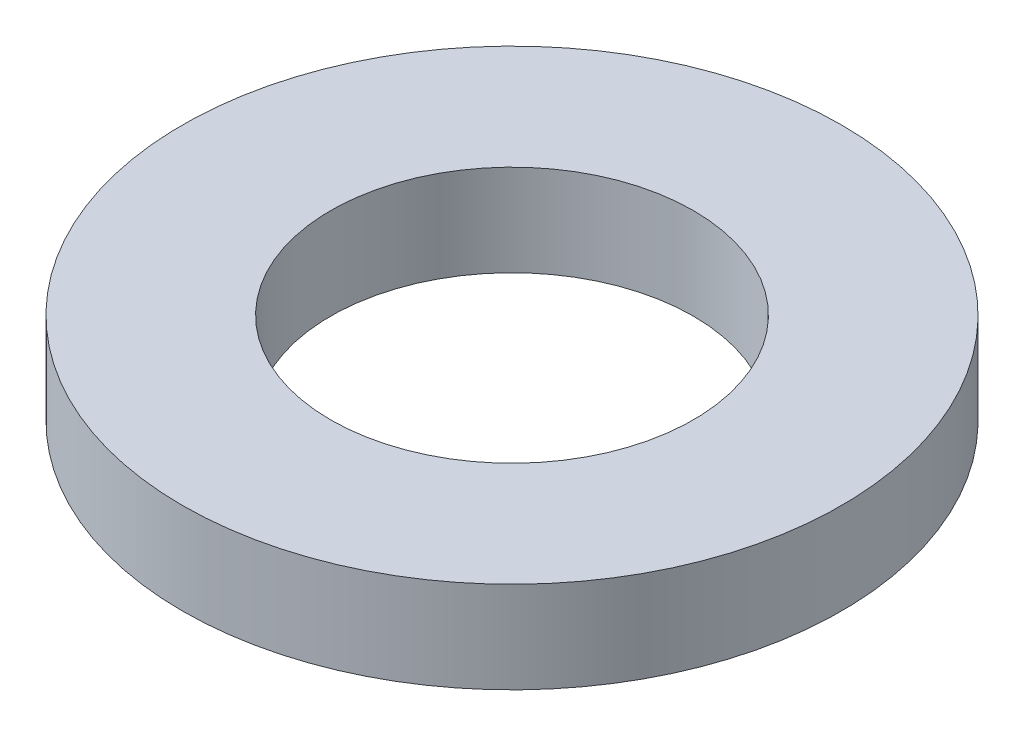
ISO-10303-21;
HEADER;
FILE_DESCRIPTION(('STEP AP214'),'2;1');
FILE_NAME('part.step','',(''),(''),'','','');
FILE_SCHEMA(('AUTOMOTIVE_DESIGN { 1 0 10303 214 1 1 1 1 }'));
ENDSEC;
DATA;
#1=APPLICATION_CONTEXT('core data for automotive mechanical design processes');
#2=APPLICATION_PROTOCOL_DEFINITION('international standard','automotive_design',2000,#1);
#3=PRODUCT_CONTEXT('',#1,'mechanical');
#4=PRODUCT('Part','Part','',(#3));
#5=PRODUCT_RELATED_PRODUCT_CATEGORY('part','',(#4));
#6=PRODUCT_DEFINITION_FORMATION('','',#4);
#7=PRODUCT_DEFINITION_CONTEXT('part definition',#1,'design');
#8=PRODUCT_DEFINITION('design','',#6,#7);
#9=PRODUCT_DEFINITION_SHAPE('','',#8);
#10=(LENGTH_UNIT() NAMED_UNIT(*) SI_UNIT(.MILLI.,.METRE.));
#11=(NAMED_UNIT(*) PLANE_ANGLE_UNIT() SI_UNIT($,.RADIAN.));
#12=(NAMED_UNIT(*) SI_UNIT($,.STERADIAN.) SOLID_ANGLE_UNIT());
#13=UNCERTAINTY_MEASURE_WITH_UNIT(LENGTH_MEASURE(1.E-05),#10,'distance_accuracy_value','');
#14=(GEOMETRIC_REPRESENTATION_CONTEXT(3) GLOBAL_UNCERTAINTY_ASSIGNED_CONTEXT((#13)) GLOBAL_UNIT_ASSIGNED_CONTEXT((#10,
#11,#12)) REPRESENTATION_CONTEXT('',''));
#15=CARTESIAN_POINT('',(0.,0.,0.));
#16=DIRECTION('',(0.,0.,1.));
#17=DIRECTION('',(1.,0.,0.));
#18=AXIS2_PLACEMENT_3D('',#15,#16,#17);
#19=CARTESIAN_POINT('',(0.,0.7366,0.));
#20=DIRECTION('',(0.,1.,0.));
#21=DIRECTION('',(0.,0.,1.));
#22=AXIS2_PLACEMENT_3D('',#19,#20,#21);
#23=PLANE('',#22);
#24=CARTESIAN_POINT('',(0.,0.7366,0.));
#25=DIRECTION('',(0.,1.,0.));
#26=DIRECTION('',(0.,0.,1.));
#27=AXIS2_PLACEMENT_3D('',#24,#25,#26);
#28=CIRCLE('',#27,2.6543);
#29=CARTESIAN_POINT('',(0.,0.7366,2.6543));
#30=VERTEX_POINT('',#29);
#31=EDGE_CURVE('E10',#30,#30,#28,.T.);
#32=ORIENTED_EDGE('',*,*,#31,.T.);
#33=EDGE_LOOP('',(#32));
#34=FACE_BOUND('',#33,.T.);
#35=CARTESIAN_POINT('',(0.,0.7366,0.));
#36=DIRECTION('',(0.,1.,0.));
#37=DIRECTION('',(0.,0.,1.));
#38=AXIS2_PLACEMENT_3D('',#35,#36,#37);
#39=CIRCLE('',#38,1.4605);
#40=CARTESIAN_POINT('',(0.,0.7366,1.4605));
#41=VERTEX_POINT('',#40);
#42=EDGE_CURVE('E39',#41,#41,#39,.T.);
#43=ORIENTED_EDGE('',*,*,#42,.F.);
#44=EDGE_LOOP('',(#43));
#45=FACE_BOUND('',#44,.T.);
#46=ADVANCED_FACE('F28',(#34,#45),#23,.T.);
#47=CARTESIAN_POINT('',(0.,0.,0.));
#48=DIRECTION('',(0.,1.,0.));
#49=DIRECTION('',(0.,0.,1.));
#50=AXIS2_PLACEMENT_3D('',#47,#48,#49);
#51=PLANE('',#50);
#52=CARTESIAN_POINT('',(0.,0.,0.));
#53=DIRECTION('',(0.,1.,0.));
#54=DIRECTION('',(0.,0.,1.));
#55=AXIS2_PLACEMENT_3D('',#52,#53,#54);
#56=CIRCLE('',#55,2.6543);
#57=CARTESIAN_POINT('',(0.,0.,2.6543));
#58=VERTEX_POINT('',#57);
#59=EDGE_CURVE('E35',#58,#58,#56,.T.);
#60=ORIENTED_EDGE('',*,*,#59,.F.);
#61=EDGE_LOOP('',(#60));
#62=FACE_BOUND('',#61,.T.);
#63=CARTESIAN_POINT('',(0.,0.,0.));
#64=DIRECTION('',(0.,1.,0.));
#65=DIRECTION('',(0.,0.,1.));
#66=AXIS2_PLACEMENT_3D('',#63,#64,#65);
#67=CIRCLE('',#66,1.4605);
#68=CARTESIAN_POINT('',(0.,0.,1.4605));
#69=VERTEX_POINT('',#68);
#70=EDGE_CURVE('E43',#69,#69,#67,.T.);
#71=ORIENTED_EDGE('',*,*,#70,.T.);
#72=EDGE_LOOP('',(#71));
#73=FACE_BOUND('',#72,.T.);
#74=ADVANCED_FACE('F49',(#62,#73),#51,.F.);
#75=CARTESIAN_POINT('',(0.,0.7366,0.));
#76=DIRECTION('',(0.,-1.,0.));
#77=DIRECTION('',(0.,0.,-1.));
#78=AXIS2_PLACEMENT_3D('',#75,#76,#77);
#79=CYLINDRICAL_SURFACE('',#78,2.6543);
#80=ORIENTED_EDGE('',*,*,#31,.F.);
#81=EDGE_LOOP('',(#80));
#82=FACE_BOUND('',#81,.T.);
#83=ORIENTED_EDGE('',*,*,#59,.T.);
#84=EDGE_LOOP('',(#83));
#85=FACE_BOUND('',#84,.T.);
#86=ADVANCED_FACE('F30',(#82,#85),#79,.T.);
#87=CARTESIAN_POINT('',(0.,0.7366,0.));
#88=DIRECTION('',(0.,-1.,0.));
#89=DIRECTION('',(0.,0.,-1.));
#90=AXIS2_PLACEMENT_3D('',#87,#88,#89);
#91=CYLINDRICAL_SURFACE('',#90,1.4605);
#92=ORIENTED_EDGE('',*,*,#42,.T.);
#93=EDGE_LOOP('',(#92));
#94=FACE_BOUND('',#93,.T.);
#95=ORIENTED_EDGE('',*,*,#70,.F.);
#96=EDGE_LOOP('',(#95));
#97=FACE_BOUND('',#96,.T.);
#98=ADVANCED_FACE('F51',(#94,#97),#91,.F.);
#99=CLOSED_SHELL('',(#46,#74,#86,#98));
#100=MANIFOLD_SOLID_BREP('B2',#99);
#101=ADVANCED_BREP_SHAPE_REPRESENTATION('',(#18,#100),#14);
#102=SHAPE_DEFINITION_REPRESENTATION(#9,#101);
ENDSEC;
END-ISO-10303-21;
